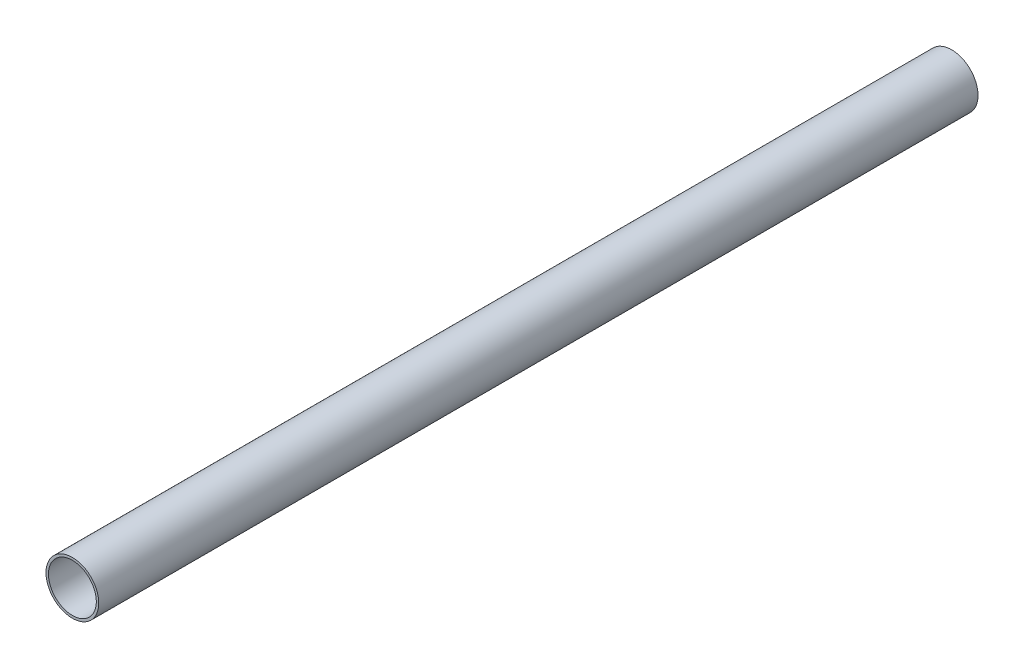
ISO-10303-21;
HEADER;
FILE_DESCRIPTION(('STEP AP214'),'2;1');
FILE_NAME('part.step','',(''),(''),'','','');
FILE_SCHEMA(('AUTOMOTIVE_DESIGN { 1 0 10303 214 1 1 1 1 }'));
ENDSEC;
DATA;
#1=APPLICATION_CONTEXT('core data for automotive mechanical design processes');
#2=APPLICATION_PROTOCOL_DEFINITION('international standard','automotive_design',2000,#1);
#3=PRODUCT_CONTEXT('',#1,'mechanical');
#4=PRODUCT('Part','Part','',(#3));
#5=PRODUCT_RELATED_PRODUCT_CATEGORY('part','',(#4));
#6=PRODUCT_DEFINITION_FORMATION('','',#4);
#7=PRODUCT_DEFINITION_CONTEXT('part definition',#1,'design');
#8=PRODUCT_DEFINITION('design','',#6,#7);
#9=PRODUCT_DEFINITION_SHAPE('','',#8);
#10=(LENGTH_UNIT() NAMED_UNIT(*) SI_UNIT(.MILLI.,.METRE.));
#11=(NAMED_UNIT(*) PLANE_ANGLE_UNIT() SI_UNIT($,.RADIAN.));
#12=(NAMED_UNIT(*) SI_UNIT($,.STERADIAN.) SOLID_ANGLE_UNIT());
#13=UNCERTAINTY_MEASURE_WITH_UNIT(LENGTH_MEASURE(1.E-05),#10,'distance_accuracy_value','');
#14=(GEOMETRIC_REPRESENTATION_CONTEXT(3) GLOBAL_UNCERTAINTY_ASSIGNED_CONTEXT((#13)) GLOBAL_UNIT_ASSIGNED_CONTEXT((#10,
#11,#12)) REPRESENTATION_CONTEXT('',''));
#15=CARTESIAN_POINT('',(0.,0.,0.));
#16=DIRECTION('',(0.,0.,1.));
#17=DIRECTION('',(1.,0.,0.));
#18=AXIS2_PLACEMENT_3D('',#15,#16,#17);
#19=CARTESIAN_POINT('',(0.,0.,158.75));
#20=DIRECTION('',(0.,0.,-1.));
#21=DIRECTION('',(-1.,0.,0.));
#22=AXIS2_PLACEMENT_3D('',#19,#20,#21);
#23=CYLINDRICAL_SURFACE('',#22,8.636);
#24=CARTESIAN_POINT('',(0.,0.,-158.75));
#25=DIRECTION('',(0.,0.,-1.));
#26=DIRECTION('',(-1.,0.,0.));
#27=AXIS2_PLACEMENT_3D('',#24,#25,#26);
#28=CIRCLE('',#27,8.636);
#29=CARTESIAN_POINT('',(-8.636,0.,-158.75));
#30=VERTEX_POINT('',#29);
#31=EDGE_CURVE('E24',#30,#30,#28,.T.);
#32=ORIENTED_EDGE('',*,*,#31,.T.);
#33=EDGE_LOOP('',(#32));
#34=FACE_BOUND('',#33,.T.);
#35=CARTESIAN_POINT('',(0.,0.,158.75));
#36=DIRECTION('',(0.,0.,-1.));
#37=DIRECTION('',(-1.,0.,0.));
#38=AXIS2_PLACEMENT_3D('',#35,#36,#37);
#39=CIRCLE('',#38,8.636);
#40=CARTESIAN_POINT('',(-8.636,0.,158.75));
#41=VERTEX_POINT('',#40);
#42=EDGE_CURVE('E15',#41,#41,#39,.T.);
#43=ORIENTED_EDGE('',*,*,#42,.F.);
#44=EDGE_LOOP('',(#43));
#45=FACE_BOUND('',#44,.T.);
#46=ADVANCED_FACE('F12',(#34,#45),#23,.F.);
#47=CARTESIAN_POINT('',(0.,0.,158.75));
#48=DIRECTION('',(0.,0.,1.));
#49=DIRECTION('',(1.,0.,0.));
#50=AXIS2_PLACEMENT_3D('',#47,#48,#49);
#51=PLANE('',#50);
#52=ORIENTED_EDGE('',*,*,#42,.T.);
#53=EDGE_LOOP('',(#52));
#54=FACE_BOUND('',#53,.T.);
#55=CARTESIAN_POINT('',(0.,0.,158.75));
#56=DIRECTION('',(0.,0.,-1.));
#57=DIRECTION('',(-1.,0.,0.));
#58=AXIS2_PLACEMENT_3D('',#55,#56,#57);
#59=CIRCLE('',#58,9.525);
#60=CARTESIAN_POINT('',(-9.525,0.,158.75));
#61=VERTEX_POINT('',#60);
#62=EDGE_CURVE('E19',#61,#61,#59,.T.);
#63=ORIENTED_EDGE('',*,*,#62,.F.);
#64=EDGE_LOOP('',(#63));
#65=FACE_BOUND('',#64,.T.);
#66=ADVANCED_FACE('F32',(#54,#65),#51,.T.);
#67=CARTESIAN_POINT('',(0.,0.,-158.75));
#68=DIRECTION('',(0.,0.,1.));
#69=DIRECTION('',(1.,0.,0.));
#70=AXIS2_PLACEMENT_3D('',#67,#68,#69);
#71=PLANE('',#70);
#72=ORIENTED_EDGE('',*,*,#31,.F.);
#73=EDGE_LOOP('',(#72));
#74=FACE_BOUND('',#73,.T.);
#75=CARTESIAN_POINT('',(0.,0.,-158.75));
#76=DIRECTION('',(0.,0.,-1.));
#77=DIRECTION('',(-1.,0.,0.));
#78=AXIS2_PLACEMENT_3D('',#75,#76,#77);
#79=CIRCLE('',#78,9.525);
#80=CARTESIAN_POINT('',(-9.525,0.,-158.75));
#81=VERTEX_POINT('',#80);
#82=EDGE_CURVE('E8',#81,#81,#79,.F.);
#83=ORIENTED_EDGE('',*,*,#82,.F.);
#84=EDGE_LOOP('',(#83));
#85=FACE_BOUND('',#84,.T.);
#86=ADVANCED_FACE('F40',(#74,#85),#71,.F.);
#87=CARTESIAN_POINT('',(0.,0.,158.75));
#88=DIRECTION('',(0.,0.,-1.));
#89=DIRECTION('',(-1.,0.,0.));
#90=AXIS2_PLACEMENT_3D('',#87,#88,#89);
#91=CYLINDRICAL_SURFACE('',#90,9.525);
#92=ORIENTED_EDGE('',*,*,#82,.T.);
#93=EDGE_LOOP('',(#92));
#94=FACE_BOUND('',#93,.T.);
#95=ORIENTED_EDGE('',*,*,#62,.T.);
#96=EDGE_LOOP('',(#95));
#97=FACE_BOUND('',#96,.T.);
#98=ADVANCED_FACE('F41',(#94,#97),#91,.T.);
#99=CLOSED_SHELL('',(#46,#66,#86,#98));
#100=MANIFOLD_SOLID_BREP('B1',#99);
#101=ADVANCED_BREP_SHAPE_REPRESENTATION('',(#18,#100),#14);
#102=SHAPE_DEFINITION_REPRESENTATION(#9,#101);
ENDSEC;
END-ISO-10303-21;
